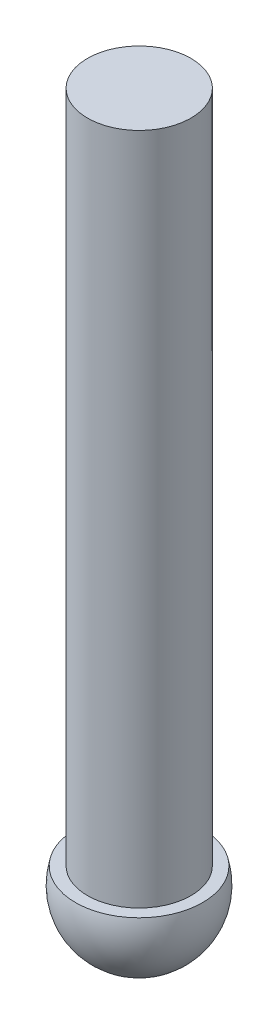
ISO-10303-21;
HEADER;
FILE_DESCRIPTION(('STEP AP214'),'2;1');
FILE_NAME('part.step','',(''),(''),'','','');
FILE_SCHEMA(('AUTOMOTIVE_DESIGN { 1 0 10303 214 1 1 1 1 }'));
ENDSEC;
DATA;
#1=APPLICATION_CONTEXT('core data for automotive mechanical design processes');
#2=APPLICATION_PROTOCOL_DEFINITION('international standard','automotive_design',2000,#1);
#3=PRODUCT_CONTEXT('',#1,'mechanical');
#4=PRODUCT('Part','Part','',(#3));
#5=PRODUCT_RELATED_PRODUCT_CATEGORY('part','',(#4));
#6=PRODUCT_DEFINITION_FORMATION('','',#4);
#7=PRODUCT_DEFINITION_CONTEXT('part definition',#1,'design');
#8=PRODUCT_DEFINITION('design','',#6,#7);
#9=PRODUCT_DEFINITION_SHAPE('','',#8);
#10=(LENGTH_UNIT() NAMED_UNIT(*) SI_UNIT(.MILLI.,.METRE.));
#11=(NAMED_UNIT(*) PLANE_ANGLE_UNIT() SI_UNIT($,.RADIAN.));
#12=(NAMED_UNIT(*) SI_UNIT($,.STERADIAN.) SOLID_ANGLE_UNIT());
#13=UNCERTAINTY_MEASURE_WITH_UNIT(LENGTH_MEASURE(1.E-05),#10,'distance_accuracy_value','');
#14=(GEOMETRIC_REPRESENTATION_CONTEXT(3) GLOBAL_UNCERTAINTY_ASSIGNED_CONTEXT((#13)) GLOBAL_UNIT_ASSIGNED_CONTEXT((#10,
#11,#12)) REPRESENTATION_CONTEXT('',''));
#15=CARTESIAN_POINT('',(0.,0.,0.));
#16=DIRECTION('',(0.,0.,1.));
#17=DIRECTION('',(1.,0.,0.));
#18=AXIS2_PLACEMENT_3D('',#15,#16,#17);
#19=CARTESIAN_POINT('',(18.4292357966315,-195.17653974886,0.));
#20=DIRECTION('',(0.,1.,0.));
#21=DIRECTION('',(0.,0.,1.));
#22=AXIS2_PLACEMENT_3D('',#19,#20,#21);
#23=PLANE('',#22);
#24=CARTESIAN_POINT('',(0.,-195.17653974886,0.));
#25=DIRECTION('',(0.,-1.,0.));
#26=DIRECTION('',(0.,0.,-1.));
#27=AXIS2_PLACEMENT_3D('',#24,#25,#26);
#28=CIRCLE('',#27,18.4292357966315);
#29=CARTESIAN_POINT('',(0.,-195.17653974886,-18.4292357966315));
#30=VERTEX_POINT('',#29);
#31=CARTESIAN_POINT('',(-18.4292357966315,-195.17653974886,0.));
#32=VERTEX_POINT('',#31);
#33=EDGE_CURVE('E76',#30,#32,#28,.T.);
#34=ORIENTED_EDGE('',*,*,#33,.F.);
#35=DIRECTION('',(0.,0.,1.));
#36=VECTOR('',#35,1.);
#37=CARTESIAN_POINT('',(0.,-195.17653974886,0.));
#38=LINE('',#37,#36);
#39=CARTESIAN_POINT('',(0.,-195.17653974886,-15.0499999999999));
#40=VERTEX_POINT('',#39);
#41=EDGE_CURVE('E11',#30,#40,#38,.T.);
#42=ORIENTED_EDGE('',*,*,#41,.T.);
#43=CARTESIAN_POINT('',(0.,-195.17653974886,-0.05));
#44=DIRECTION('',(0.,1.,0.));
#45=DIRECTION('',(0.,0.,1.));
#46=AXIS2_PLACEMENT_3D('',#43,#44,#45);
#47=CIRCLE('',#46,14.9999999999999);
#48=CARTESIAN_POINT('',(-14.9999166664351,-195.17653974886,0.));
#49=VERTEX_POINT('',#48);
#50=EDGE_CURVE('E68',#40,#49,#47,.F.);
#51=ORIENTED_EDGE('',*,*,#50,.T.);
#52=DIRECTION('',(-1.,0.,0.));
#53=VECTOR('',#52,1.);
#54=CARTESIAN_POINT('',(18.4292357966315,-195.17653974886,0.));
#55=LINE('',#54,#53);
#56=EDGE_CURVE('E45',#49,#32,#55,.T.);
#57=ORIENTED_EDGE('',*,*,#56,.T.);
#58=EDGE_LOOP('',(#34,#42,#51,#57));
#59=FACE_BOUND('',#58,.T.);
#60=ADVANCED_FACE('F36',(#59),#23,.T.);
#61=CARTESIAN_POINT('',(0.,-199.9999999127,-0.05));
#62=DIRECTION('',(0.,1.,0.));
#63=DIRECTION('',(0.,0.,1.));
#64=AXIS2_PLACEMENT_3D('',#61,#62,#63);
#65=CYLINDRICAL_SURFACE('',#64,14.9999999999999);
#66=EDGE_CURVE('E63',#49,#40,#47,.F.);
#67=ORIENTED_EDGE('',*,*,#66,.F.);
#68=ORIENTED_EDGE('',*,*,#50,.F.);
#69=EDGE_LOOP('',(#67,#68));
#70=FACE_BOUND('',#69,.T.);
#71=CARTESIAN_POINT('',(0.,-4.44089209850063E-13,-0.05));
#72=DIRECTION('',(0.,1.,0.));
#73=DIRECTION('',(0.,0.,-1.));
#74=AXIS2_PLACEMENT_3D('',#71,#72,#73);
#75=CIRCLE('',#74,14.9999999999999);
#76=CARTESIAN_POINT('',(0.,-4.44089209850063E-13,-15.0499999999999));
#77=VERTEX_POINT('',#76);
#78=EDGE_CURVE('E70',#77,#77,#75,.T.);
#79=ORIENTED_EDGE('',*,*,#78,.F.);
#80=EDGE_LOOP('',(#79));
#81=FACE_BOUND('',#80,.T.);
#82=ADVANCED_FACE('F38',(#70,#81),#65,.T.);
#83=CARTESIAN_POINT('',(0.,-4.44089209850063E-13,-0.05));
#84=DIRECTION('',(0.,-1.,0.));
#85=DIRECTION('',(0.,0.,-1.));
#86=AXIS2_PLACEMENT_3D('',#83,#84,#85);
#87=PLANE('',#86);
#88=ORIENTED_EDGE('',*,*,#78,.T.);
#89=EDGE_LOOP('',(#88));
#90=FACE_BOUND('',#89,.T.);
#91=ADVANCED_FACE('F80',(#90),#87,.F.);
#92=CARTESIAN_POINT('',(0.,-199.9999999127,0.));
#93=DIRECTION('',(0.,-1.,0.));
#94=DIRECTION('',(-1.,0.,0.));
#95=AXIS2_PLACEMENT_3D('',#92,#93,#94);
#96=SPHERICAL_SURFACE('',#95,19.05);
#97=ORIENTED_EDGE('',*,*,#33,.T.);
#98=EDGE_CURVE('E64',#32,#30,#28,.T.);
#99=ORIENTED_EDGE('',*,*,#98,.T.);
#100=EDGE_LOOP('',(#97,#99));
#101=FACE_BOUND('',#100,.T.);
#102=ADVANCED_FACE('F78',(#101),#96,.T.);
#103=ORIENTED_EDGE('',*,*,#41,.F.);
#104=ORIENTED_EDGE('',*,*,#98,.F.);
#105=ORIENTED_EDGE('',*,*,#56,.F.);
#106=ORIENTED_EDGE('',*,*,#66,.T.);
#107=EDGE_LOOP('',(#103,#104,#105,#106));
#108=FACE_BOUND('',#107,.T.);
#109=ADVANCED_FACE('F61',(#108),#23,.T.);
#110=CLOSED_SHELL('',(#60,#82,#91,#102,#109));
#111=MANIFOLD_SOLID_BREP('B2',#110);
#112=ADVANCED_BREP_SHAPE_REPRESENTATION('',(#18,#111),#14);
#113=SHAPE_DEFINITION_REPRESENTATION(#9,#112);
ENDSEC;
END-ISO-10303-21;
